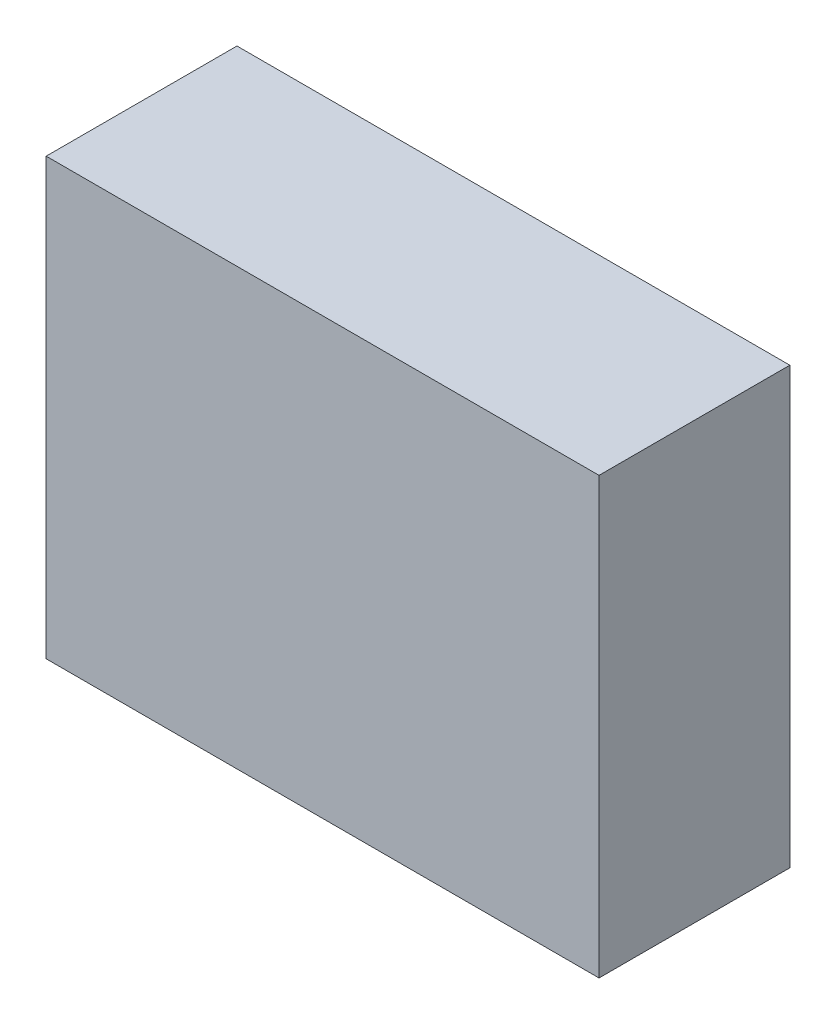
ISO-10303-21;
HEADER;
FILE_DESCRIPTION(('STEP AP214'),'2;1');
FILE_NAME('part.step','',(''),(''),'','','');
FILE_SCHEMA(('AUTOMOTIVE_DESIGN { 1 0 10303 214 1 1 1 1 }'));
ENDSEC;
DATA;
#1=APPLICATION_CONTEXT('core data for automotive mechanical design processes');
#2=APPLICATION_PROTOCOL_DEFINITION('international standard','automotive_design',2000,#1);
#3=PRODUCT_CONTEXT('',#1,'mechanical');
#4=PRODUCT('Part','Part','',(#3));
#5=PRODUCT_RELATED_PRODUCT_CATEGORY('part','',(#4));
#6=PRODUCT_DEFINITION_FORMATION('','',#4);
#7=PRODUCT_DEFINITION_CONTEXT('part definition',#1,'design');
#8=PRODUCT_DEFINITION('design','',#6,#7);
#9=PRODUCT_DEFINITION_SHAPE('','',#8);
#10=(LENGTH_UNIT() NAMED_UNIT(*) SI_UNIT(.MILLI.,.METRE.));
#11=(NAMED_UNIT(*) PLANE_ANGLE_UNIT() SI_UNIT($,.RADIAN.));
#12=(NAMED_UNIT(*) SI_UNIT($,.STERADIAN.) SOLID_ANGLE_UNIT());
#13=UNCERTAINTY_MEASURE_WITH_UNIT(LENGTH_MEASURE(1.E-05),#10,'distance_accuracy_value','');
#14=(GEOMETRIC_REPRESENTATION_CONTEXT(3) GLOBAL_UNCERTAINTY_ASSIGNED_CONTEXT((#13)) GLOBAL_UNIT_ASSIGNED_CONTEXT((#10,
#11,#12)) REPRESENTATION_CONTEXT('',''));
#15=CARTESIAN_POINT('',(0.,0.,0.));
#16=DIRECTION('',(0.,0.,1.));
#17=DIRECTION('',(1.,0.,0.));
#18=AXIS2_PLACEMENT_3D('',#15,#16,#17);
#19=CARTESIAN_POINT('',(-2.54,2.0000000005,1.753));
#20=DIRECTION('',(1.,0.,0.));
#21=DIRECTION('',(0.,0.,-1.));
#22=AXIS2_PLACEMENT_3D('',#19,#20,#21);
#23=PLANE('',#22);
#24=DIRECTION('',(0.,-1.,0.));
#25=VECTOR('',#24,1.);
#26=CARTESIAN_POINT('',(-2.54,2.0000000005,0.));
#27=LINE('',#26,#25);
#28=CARTESIAN_POINT('',(-2.54,2.0000000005,0.));
#29=VERTEX_POINT('',#28);
#30=CARTESIAN_POINT('',(-2.54,-2.0000000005,0.));
#31=VERTEX_POINT('',#30);
#32=EDGE_CURVE('E96',#29,#31,#27,.T.);
#33=ORIENTED_EDGE('',*,*,#32,.T.);
#34=DIRECTION('',(0.,0.,-1.));
#35=VECTOR('',#34,1.);
#36=CARTESIAN_POINT('',(-2.54,-2.0000000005,1.753));
#37=LINE('',#36,#35);
#38=CARTESIAN_POINT('',(-2.54,-2.0000000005,1.753));
#39=VERTEX_POINT('',#38);
#40=EDGE_CURVE('E11',#39,#31,#37,.T.);
#41=ORIENTED_EDGE('',*,*,#40,.F.);
#42=DIRECTION('',(0.,-1.,0.));
#43=VECTOR('',#42,1.);
#44=CARTESIAN_POINT('',(-2.54,2.0000000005,1.753));
#45=LINE('',#44,#43);
#46=CARTESIAN_POINT('',(-2.54,2.0000000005,1.753));
#47=VERTEX_POINT('',#46);
#48=EDGE_CURVE('E84',#47,#39,#45,.T.);
#49=ORIENTED_EDGE('',*,*,#48,.F.);
#50=DIRECTION('',(0.,0.,-1.));
#51=VECTOR('',#50,1.);
#52=CARTESIAN_POINT('',(-2.54,2.0000000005,1.753));
#53=LINE('',#52,#51);
#54=EDGE_CURVE('E92',#47,#29,#53,.T.);
#55=ORIENTED_EDGE('',*,*,#54,.T.);
#56=EDGE_LOOP('',(#33,#41,#49,#55));
#57=FACE_BOUND('',#56,.T.);
#58=ADVANCED_FACE('F33',(#57),#23,.F.);
#59=CARTESIAN_POINT('',(-2.54,-2.0000000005,1.753));
#60=DIRECTION('',(0.,1.,0.));
#61=DIRECTION('',(0.,0.,1.));
#62=AXIS2_PLACEMENT_3D('',#59,#60,#61);
#63=PLANE('',#62);
#64=DIRECTION('',(1.,0.,0.));
#65=VECTOR('',#64,1.);
#66=CARTESIAN_POINT('',(-2.54,-2.0000000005,0.));
#67=LINE('',#66,#65);
#68=CARTESIAN_POINT('',(2.54,-2.0000000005,0.));
#69=VERTEX_POINT('',#68);
#70=EDGE_CURVE('E88',#31,#69,#67,.T.);
#71=ORIENTED_EDGE('',*,*,#70,.T.);
#72=DIRECTION('',(0.,0.,-1.));
#73=VECTOR('',#72,1.);
#74=CARTESIAN_POINT('',(2.54,-2.0000000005,1.753));
#75=LINE('',#74,#73);
#76=CARTESIAN_POINT('',(2.54,-2.0000000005,1.753));
#77=VERTEX_POINT('',#76);
#78=EDGE_CURVE('E41',#77,#69,#75,.T.);
#79=ORIENTED_EDGE('',*,*,#78,.F.);
#80=DIRECTION('',(1.,0.,0.));
#81=VECTOR('',#80,1.);
#82=CARTESIAN_POINT('',(-2.54,-2.0000000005,1.753));
#83=LINE('',#82,#81);
#84=EDGE_CURVE('E79',#39,#77,#83,.T.);
#85=ORIENTED_EDGE('',*,*,#84,.F.);
#86=ORIENTED_EDGE('',*,*,#40,.T.);
#87=EDGE_LOOP('',(#71,#79,#85,#86));
#88=FACE_BOUND('',#87,.T.);
#89=ADVANCED_FACE('F87',(#88),#63,.F.);
#90=CARTESIAN_POINT('',(2.54,-2.0000000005,1.753));
#91=DIRECTION('',(-1.,0.,0.));
#92=DIRECTION('',(0.,0.,1.));
#93=AXIS2_PLACEMENT_3D('',#90,#91,#92);
#94=PLANE('',#93);
#95=DIRECTION('',(0.,1.,0.));
#96=VECTOR('',#95,1.);
#97=CARTESIAN_POINT('',(2.54,-2.0000000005,0.));
#98=LINE('',#97,#96);
#99=CARTESIAN_POINT('',(2.54,2.0000000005,0.));
#100=VERTEX_POINT('',#99);
#101=EDGE_CURVE('E66',#69,#100,#98,.T.);
#102=ORIENTED_EDGE('',*,*,#101,.T.);
#103=DIRECTION('',(0.,0.,-1.));
#104=VECTOR('',#103,1.);
#105=CARTESIAN_POINT('',(2.54,2.0000000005,1.753));
#106=LINE('',#105,#104);
#107=CARTESIAN_POINT('',(2.54,2.0000000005,1.753));
#108=VERTEX_POINT('',#107);
#109=EDGE_CURVE('E89',#108,#100,#106,.T.);
#110=ORIENTED_EDGE('',*,*,#109,.F.);
#111=DIRECTION('',(0.,1.,0.));
#112=VECTOR('',#111,1.);
#113=CARTESIAN_POINT('',(2.54,-2.0000000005,1.753));
#114=LINE('',#113,#112);
#115=EDGE_CURVE('E82',#77,#108,#114,.T.);
#116=ORIENTED_EDGE('',*,*,#115,.F.);
#117=ORIENTED_EDGE('',*,*,#78,.T.);
#118=EDGE_LOOP('',(#102,#110,#116,#117));
#119=FACE_BOUND('',#118,.T.);
#120=ADVANCED_FACE('F90',(#119),#94,.F.);
#121=CARTESIAN_POINT('',(2.54,2.0000000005,1.753));
#122=DIRECTION('',(0.,-1.,0.));
#123=DIRECTION('',(0.,0.,-1.));
#124=AXIS2_PLACEMENT_3D('',#121,#122,#123);
#125=PLANE('',#124);
#126=DIRECTION('',(-1.,0.,0.));
#127=VECTOR('',#126,1.);
#128=CARTESIAN_POINT('',(2.54,2.0000000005,0.));
#129=LINE('',#128,#127);
#130=EDGE_CURVE('E72',#100,#29,#129,.T.);
#131=ORIENTED_EDGE('',*,*,#130,.T.);
#132=ORIENTED_EDGE('',*,*,#54,.F.);
#133=DIRECTION('',(-1.,0.,0.));
#134=VECTOR('',#133,1.);
#135=CARTESIAN_POINT('',(2.54,2.0000000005,1.753));
#136=LINE('',#135,#134);
#137=EDGE_CURVE('E49',#108,#47,#136,.T.);
#138=ORIENTED_EDGE('',*,*,#137,.F.);
#139=ORIENTED_EDGE('',*,*,#109,.T.);
#140=EDGE_LOOP('',(#131,#132,#138,#139));
#141=FACE_BOUND('',#140,.T.);
#142=ADVANCED_FACE('F103',(#141),#125,.F.);
#143=CARTESIAN_POINT('',(0.,0.,1.753));
#144=DIRECTION('',(0.,0.,1.));
#145=DIRECTION('',(1.,0.,0.));
#146=AXIS2_PLACEMENT_3D('',#143,#144,#145);
#147=PLANE('',#146);
#148=ORIENTED_EDGE('',*,*,#48,.T.);
#149=ORIENTED_EDGE('',*,*,#84,.T.);
#150=ORIENTED_EDGE('',*,*,#115,.T.);
#151=ORIENTED_EDGE('',*,*,#137,.T.);
#152=EDGE_LOOP('',(#148,#149,#150,#151));
#153=FACE_BOUND('',#152,.T.);
#154=ADVANCED_FACE('F80',(#153),#147,.T.);
#155=CARTESIAN_POINT('',(0.,0.,0.));
#156=DIRECTION('',(0.,0.,1.));
#157=DIRECTION('',(1.,0.,0.));
#158=AXIS2_PLACEMENT_3D('',#155,#156,#157);
#159=PLANE('',#158);
#160=ORIENTED_EDGE('',*,*,#32,.F.);
#161=ORIENTED_EDGE('',*,*,#130,.F.);
#162=ORIENTED_EDGE('',*,*,#101,.F.);
#163=ORIENTED_EDGE('',*,*,#70,.F.);
#164=EDGE_LOOP('',(#160,#161,#162,#163));
#165=FACE_BOUND('',#164,.T.);
#166=ADVANCED_FACE('F106',(#165),#159,.F.);
#167=CLOSED_SHELL('',(#58,#89,#120,#142,#154,#166));
#168=MANIFOLD_SOLID_BREP('B2',#167);
#169=ADVANCED_BREP_SHAPE_REPRESENTATION('',(#18,#168),#14);
#170=SHAPE_DEFINITION_REPRESENTATION(#9,#169);
ENDSEC;
END-ISO-10303-21;
